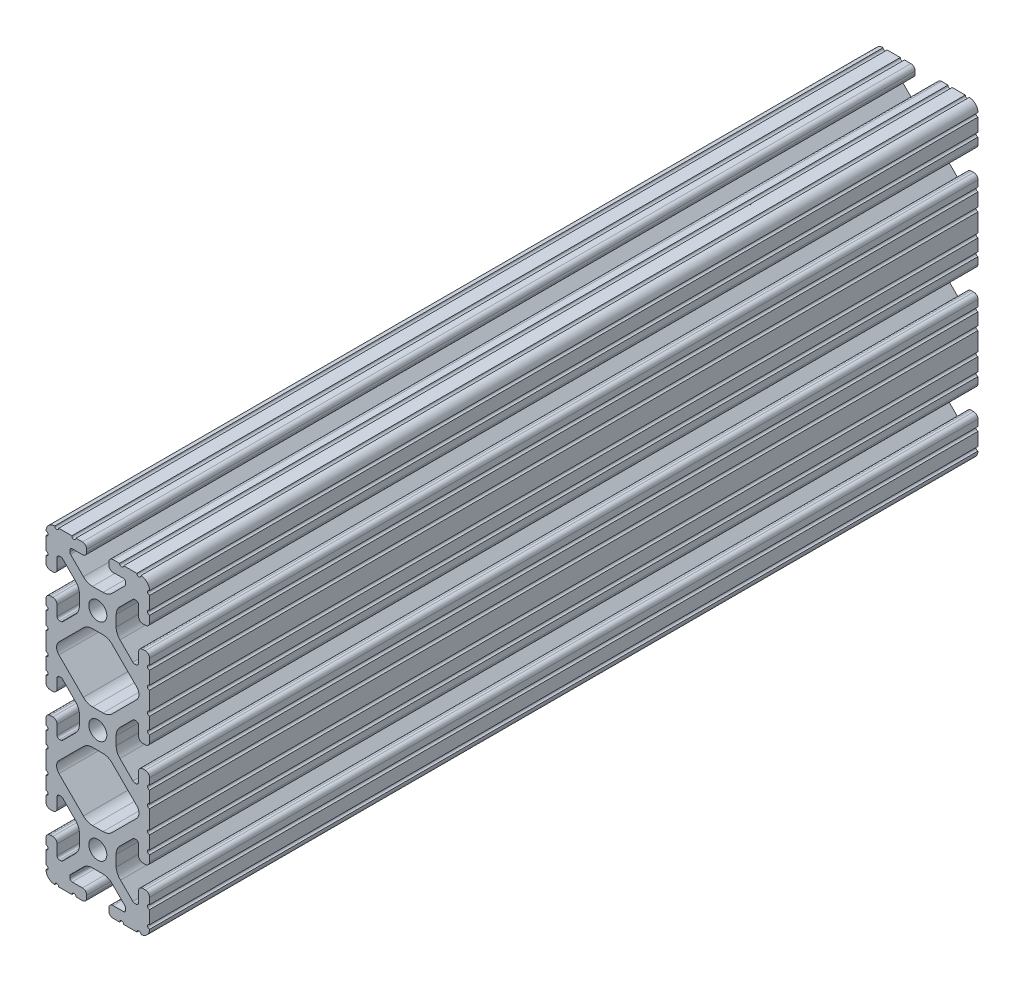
from build123d import *

# Parameters (mm, degrees)
SKETCH1_R      = 3.3274
EXTRUDE1_DEPTH = 304.8


with BuildPart() as part:
    # Sketch1 → Extrude1 (new body)
    with BuildSketch(Plane.XY):
        with BuildLine():
            Line((13.589600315, -10.019462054), (14.097, -10.019462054))
            ThreePointArc((14.097, -10.019462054), (14.725617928, -9.759079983), (14.986, -9.130462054))
            Line((14.986, -9.130462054), (14.986, -5.6388))
            ThreePointArc((14.986, -5.6388), (15.447248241, -4.525248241), (16.5608, -4.064))
            Line((16.5608, -4.064), (17.4752, -4.064))
            ThreePointArc((17.4752, -4.064), (18.588751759, -4.525248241), (19.05, -5.6388))
            Line((19.05, -5.6388), (19.05, -8.023791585))
            ThreePointArc((19.05, -8.023791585), (18.288, -8.785791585), (19.05, -9.547791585))
            Line((19.05, -9.547791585), (19.05, -12.750606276))
            Line((19.05, -12.750606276), (19.05, -13.984497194))
            ThreePointArc((19.05, -13.984497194), (18.288000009, -14.746497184), (19.05, -15.508497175))
            Line((19.05, -15.508497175), (19.05, -22.30100558))
            ThreePointArc((19.05, -22.30100558), (18.288, -23.06300558), (19.05, -23.82500558))
            Line((19.05, -23.82500558), (19.05, -27.813))
            Line((19.05, -27.813), (19.05, -28.653420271))
            ThreePointArc((19.05, -28.653420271), (18.288, -29.415420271), (19.05, -30.177420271))
            Line((19.05, -30.177420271), (19.05, -32.4612))
            ThreePointArc((19.05, -32.4612), (18.588751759, -33.574751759), (17.4752, -34.036))
            Line((17.4752, -34.036), (16.5608, -34.036))
            ThreePointArc((16.5608, -34.036), (15.447248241, -33.574751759), (14.986, -32.4612))
            Line((14.986, -32.4612), (14.986, -28.7208616))
            ThreePointArc((14.986, -28.7208616), (14.725617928, -28.092243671), (14.097, -27.8318616))
            Line((14.097, -27.8318616), (13.547779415, -27.8318616))
            ThreePointArc((13.547779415, -27.8318616), (13.207573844, -27.899532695), (12.919161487, -28.092243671))
            Line((12.919161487, -28.092243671), (8.147584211, -32.863820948))
            ThreePointArc((8.147584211, -32.863820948), (7.117956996, -34.40476697), (6.7564, -36.222436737))
            Line((6.7564, -36.222436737), (6.7564, -40.243886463))
            ThreePointArc((6.7564, -40.243886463), (7.222930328, -42.088789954), (8.376184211, -43.602502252))
            Line((8.376184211, -43.602502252), (12.919161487, -48.145479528))
            ThreePointArc((12.919161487, -48.145479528), (13.207573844, -48.338190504), (13.547779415, -48.4058616))
            Line((13.547779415, -48.4058616), (14.097, -48.4058616))
            ThreePointArc((14.097, -48.4058616), (14.725617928, -48.145479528), (14.986, -47.5168616))
            Line((14.986, -47.5168616), (14.986, -43.7388))
            ThreePointArc((14.986, -43.7388), (15.447248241, -42.625248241), (16.5608, -42.164))
            Line((16.5608, -42.164), (17.4752, -42.164))
            ThreePointArc((17.4752, -42.164), (18.588751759, -42.625248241), (19.05, -43.7388))
            Line((19.05, -43.7388), (19.05, -46.125701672))
            ThreePointArc((19.05, -46.125701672), (18.288, -46.887701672), (19.05, -47.649701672))
            Line((19.05, -47.649701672), (19.05, -48.387))
            Line((19.05, -48.387), (19.05, -52.476140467))
            ThreePointArc((19.05, -52.476140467), (18.2879999, -53.201256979), (19.049898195, -53.92648046))
            ThreePointArc((19.049898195, -53.92648046), (18.099426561, -56.199426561), (15.82648046, -57.149898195))
            ThreePointArc((15.82648046, -57.149898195), (15.101256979, -56.3879999), (14.376140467, -57.15))
            Line((14.376140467, -57.15), (9.549701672, -57.15))
            ThreePointArc((9.549701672, -57.15), (8.787701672, -56.388), (8.025701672, -57.15))
            Line((8.025701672, -57.15), (5.6388, -57.15))
            ThreePointArc((5.6388, -57.15), (4.525248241, -56.688751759), (4.064, -55.5752))
            Line((4.064, -55.5752), (4.064, -54.6608))
            ThreePointArc((4.064, -54.6608), (4.525248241, -53.547248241), (5.6388, -53.086))
            Line((5.6388, -53.086), (9.4168616, -53.086))
            ThreePointArc((9.4168616, -53.086), (10.032142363, -52.831142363), (10.287, -52.2158616))
            Line((10.287, -52.2158616), (10.287, -51.628917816))
            ThreePointArc((10.287, -51.628917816), (10.219328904, -51.288712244), (10.026617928, -51.000299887))
            Line((10.026617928, -51.000299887), (5.273902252, -46.247584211))
            ThreePointArc((5.273902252, -46.247584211), (3.73295623, -45.217956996), (1.915286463, -44.8564))
            Line((1.915286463, -44.8564), (-1.915286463, -44.8564))
            ThreePointArc((-1.915286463, -44.8564), (-3.73295623, -45.217956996), (-5.273902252, -46.247584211))
            Line((-5.273902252, -46.247584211), (-10.026617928, -51.000299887))
            ThreePointArc((-10.026617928, -51.000299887), (-10.219328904, -51.288712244), (-10.287, -51.628917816))
            Line((-10.287, -51.628917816), (-10.287, -52.2158616))
            ThreePointArc((-10.287, -52.2158616), (-10.032142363, -52.831142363), (-9.4168616, -53.086))
            Line((-9.4168616, -53.086), (-5.6388, -53.086))
            ThreePointArc((-5.6388, -53.086), (-4.525248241, -53.547248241), (-4.064, -54.6608))
            Line((-4.064, -54.6608), (-4.064, -55.5752))
            ThreePointArc((-4.064, -55.5752), (-4.525248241, -56.688751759), (-5.6388, -57.15))
            Line((-5.6388, -57.15), (-8.025701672, -57.15))
            ThreePointArc((-8.025701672, -57.15), (-8.787701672, -56.388), (-9.549701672, -57.15))
            Line((-9.549701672, -57.15), (-14.376140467, -57.15))
            ThreePointArc((-14.376140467, -57.15), (-15.101256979, -56.3879999), (-15.82648046, -57.149898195))
            ThreePointArc((-15.82648046, -57.149898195), (-18.099426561, -56.199426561), (-19.049898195, -53.92648046))
            ThreePointArc((-19.049898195, -53.92648046), (-18.2879999, -53.201256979), (-19.05, -52.476140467))
            Line((-19.05, -52.476140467), (-19.05, -48.387))
            Line((-19.05, -48.387), (-19.05, -47.649701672))
            ThreePointArc((-19.05, -47.649701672), (-18.288, -46.887701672), (-19.05, -46.125701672))
            Line((-19.05, -46.125701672), (-19.05, -43.7388))
            ThreePointArc((-19.05, -43.7388), (-18.588751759, -42.625248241), (-17.4752, -42.164))
            Line((-17.4752, -42.164), (-16.5608, -42.164))
            ThreePointArc((-16.5608, -42.164), (-15.447248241, -42.625248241), (-14.986, -43.7388))
            Line((-14.986, -43.7388), (-14.986, -47.5168616))
            ThreePointArc((-14.986, -47.5168616), (-14.725617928, -48.145479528), (-14.097, -48.4058616))
            Line((-14.097, -48.4058616), (-13.547779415, -48.4058616))
            ThreePointArc((-13.547779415, -48.4058616), (-13.207573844, -48.338190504), (-12.919161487, -48.145479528))
            Line((-12.919161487, -48.145479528), (-8.376184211, -43.602502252))
            ThreePointArc((-8.376184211, -43.602502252), (-7.222930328, -42.088789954), (-6.7564, -40.243886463))
            Line((-6.7564, -40.243886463), (-6.7564, -36.222436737))
            ThreePointArc((-6.7564, -36.222436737), (-7.117956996, -34.40476697), (-8.147584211, -32.863820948))
            Line((-8.147584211, -32.863820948), (-12.919161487, -28.092243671))
            ThreePointArc((-12.919161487, -28.092243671), (-13.207573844, -27.899532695), (-13.547779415, -27.8318616))
            Line((-13.547779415, -27.8318616), (-14.097, -27.8318616))
            ThreePointArc((-14.097, -27.8318616), (-14.725617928, -28.092243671), (-14.986, -28.7208616))
            Line((-14.986, -28.7208616), (-14.986, -32.4612))
            ThreePointArc((-14.986, -32.4612), (-15.447248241, -33.574751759), (-16.5608, -34.036))
            Line((-16.5608, -34.036), (-17.4752, -34.036))
            ThreePointArc((-17.4752, -34.036), (-18.588751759, -33.574751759), (-19.05, -32.4612))
            Line((-19.05, -32.4612), (-19.05, -30.177420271))
            ThreePointArc((-19.05, -30.177420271), (-18.288, -29.415420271), (-19.05, -28.653420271))
            Line((-19.05, -28.653420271), (-19.05, -27.813))
            Line((-19.05, -27.813), (-19.05, -23.82500558))
            ThreePointArc((-19.05, -23.82500558), (-18.288, -23.06300558), (-19.05, -22.30100558))
            Line((-19.05, -22.30100558), (-19.05, -15.508497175))
            ThreePointArc((-19.05, -15.508497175), (-18.288000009, -14.746497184), (-19.05, -13.984497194))
            Line((-19.05, -13.984497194), (-19.05, -12.750606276))
            Line((-19.05, -12.750606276), (-19.05, -9.547791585))
            ThreePointArc((-19.05, -9.547791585), (-18.288, -8.785791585), (-19.05, -8.023791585))
            Line((-19.05, -8.023791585), (-19.05, -5.6388))
            ThreePointArc((-19.05, -5.6388), (-18.588751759, -4.525248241), (-17.4752, -4.064))
            Line((-17.4752, -4.064), (-16.5608, -4.064))
            ThreePointArc((-16.5608, -4.064), (-15.447248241, -4.525248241), (-14.986, -5.6388))
            Line((-14.986, -5.6388), (-14.986, -9.130462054))
            ThreePointArc((-14.986, -9.130462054), (-14.725617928, -9.759079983), (-14.097, -10.019462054))
            Line((-14.097, -10.019462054), (-13.589600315, -10.019462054))
            ThreePointArc((-13.589600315, -10.019462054), (-13.249394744, -9.951790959), (-12.960982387, -9.759079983))
            Line((-12.960982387, -9.759079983), (-8.147584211, -4.945681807))
            ThreePointArc((-8.147584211, -4.945681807), (-7.117956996, -3.404735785), (-6.7564, -1.587066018))
            Line((-6.7564, -1.587066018), (-6.7564, 1.587066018))
            ThreePointArc((-6.7564, 1.587066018), (-7.117956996, 3.404735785), (-8.147584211, 4.945681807))
            Line((-8.147584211, 4.945681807), (-12.960982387, 9.759079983))
            ThreePointArc((-12.960982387, 9.759079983), (-13.249394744, 9.951790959), (-13.589600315, 10.019462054))
            Line((-13.589600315, 10.019462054), (-14.097, 10.019462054))
            ThreePointArc((-14.097, 10.019462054), (-14.725617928, 9.759079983), (-14.986, 9.130462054))
            Line((-14.986, 9.130462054), (-14.986, 5.6388))
            ThreePointArc((-14.986, 5.6388), (-15.447248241, 4.525248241), (-16.5608, 4.064))
            Line((-16.5608, 4.064), (-17.4752, 4.064))
            ThreePointArc((-17.4752, 4.064), (-18.588751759, 4.525248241), (-19.05, 5.6388))
            Line((-19.05, 5.6388), (-19.05, 8.023791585))
            ThreePointArc((-19.05, 8.023791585), (-18.288, 8.785791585), (-19.05, 9.547791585))
            Line((-19.05, 9.547791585), (-19.05, 12.750606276))
            Line((-19.05, 12.750606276), (-19.05, 13.984497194))
            ThreePointArc((-19.05, 13.984497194), (-18.288000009, 14.746497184), (-19.05, 15.508497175))
            Line((-19.05, 15.508497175), (-19.05, 22.30100558))
            ThreePointArc((-19.05, 22.30100558), (-18.288, 23.06300558), (-19.05, 23.82500558))
            Line((-19.05, 23.82500558), (-19.05, 27.813))
            Line((-19.05, 27.813), (-19.05, 28.653420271))
            ThreePointArc((-19.05, 28.653420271), (-18.288, 29.415420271), (-19.05, 30.177420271))
            Line((-19.05, 30.177420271), (-19.05, 32.4612))
            ThreePointArc((-19.05, 32.4612), (-18.588751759, 33.574751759), (-17.4752, 34.036))
            Line((-17.4752, 34.036), (-16.5608, 34.036))
            ThreePointArc((-16.5608, 34.036), (-15.447248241, 33.574751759), (-14.986, 32.4612))
            Line((-14.986, 32.4612), (-14.986, 28.7208616))
            ThreePointArc((-14.986, 28.7208616), (-14.725617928, 28.092243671), (-14.097, 27.8318616))
            Line((-14.097, 27.8318616), (-13.547779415, 27.8318616))
            ThreePointArc((-13.547779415, 27.8318616), (-13.207573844, 27.899532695), (-12.919161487, 28.092243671))
            Line((-12.919161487, 28.092243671), (-8.147584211, 32.863820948))
            ThreePointArc((-8.147584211, 32.863820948), (-7.117956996, 34.40476697), (-6.7564, 36.222436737))
            Line((-6.7564, 36.222436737), (-6.7564, 40.243886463))
            ThreePointArc((-6.7564, 40.243886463), (-7.222930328, 42.088789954), (-8.376184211, 43.602502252))
            Line((-8.376184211, 43.602502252), (-12.919161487, 48.145479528))
            ThreePointArc((-12.919161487, 48.145479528), (-13.207573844, 48.338190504), (-13.547779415, 48.4058616))
            Line((-13.547779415, 48.4058616), (-14.097, 48.4058616))
            ThreePointArc((-14.097, 48.4058616), (-14.725617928, 48.145479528), (-14.986, 47.5168616))
            Line((-14.986, 47.5168616), (-14.986, 43.7388))
            ThreePointArc((-14.986, 43.7388), (-15.447248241, 42.625248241), (-16.5608, 42.164))
            Line((-16.5608, 42.164), (-17.4752, 42.164))
            ThreePointArc((-17.4752, 42.164), (-18.588751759, 42.625248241), (-19.05, 43.7388))
            Line((-19.05, 43.7388), (-19.05, 46.125701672))
            ThreePointArc((-19.05, 46.125701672), (-18.288, 46.887701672), (-19.05, 47.649701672))
            Line((-19.05, 47.649701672), (-19.05, 48.387))
            Line((-19.05, 48.387), (-19.05, 52.476140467))
            ThreePointArc((-19.05, 52.476140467), (-18.2879999, 53.201256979), (-19.049898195, 53.92648046))
            ThreePointArc((-19.049898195, 53.92648046), (-18.099426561, 56.199426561), (-15.82648046, 57.149898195))
            ThreePointArc((-15.82648046, 57.149898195), (-15.101256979, 56.3879999), (-14.376140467, 57.15))
            Line((-14.376140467, 57.15), (-9.549701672, 57.15))
            ThreePointArc((-9.549701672, 57.15), (-8.787701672, 56.388), (-8.025701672, 57.15))
            Line((-8.025701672, 57.15), (-5.6388, 57.15))
            ThreePointArc((-5.6388, 57.15), (-4.525248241, 56.688751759), (-4.064, 55.5752))
            Line((-4.064, 55.5752), (-4.064, 54.6608))
            ThreePointArc((-4.064, 54.6608), (-4.525248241, 53.547248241), (-5.6388, 53.086))
            Line((-5.6388, 53.086), (-9.4168616, 53.086))
            ThreePointArc((-9.4168616, 53.086), (-10.032142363, 52.831142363), (-10.287, 52.2158616))
            Line((-10.287, 52.2158616), (-10.287, 51.628917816))
            ThreePointArc((-10.287, 51.628917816), (-10.219328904, 51.288712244), (-10.026617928, 51.000299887))
            Line((-10.026617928, 51.000299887), (-5.273902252, 46.247584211))
            ThreePointArc((-5.273902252, 46.247584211), (-3.73295623, 45.217956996), (-1.915286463, 44.8564))
            Line((-1.915286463, 44.8564), (1.915286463, 44.8564))
            ThreePointArc((1.915286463, 44.8564), (3.73295623, 45.217956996), (5.273902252, 46.247584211))
            Line((5.273902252, 46.247584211), (10.026617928, 51.000299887))
            ThreePointArc((10.026617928, 51.000299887), (10.219328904, 51.288712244), (10.287, 51.628917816))
            Line((10.287, 51.628917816), (10.287, 52.2158616))
            ThreePointArc((10.287, 52.2158616), (10.032142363, 52.831142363), (9.4168616, 53.086))
            Line((9.4168616, 53.086), (5.6388, 53.086))
            ThreePointArc((5.6388, 53.086), (4.525248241, 53.547248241), (4.064, 54.6608))
            Line((4.064, 54.6608), (4.064, 55.5752))
            ThreePointArc((4.064, 55.5752), (4.525248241, 56.688751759), (5.6388, 57.15))
            Line((5.6388, 57.15), (8.025701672, 57.15))
            ThreePointArc((8.025701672, 57.15), (8.787701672, 56.388), (9.549701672, 57.15))
            Line((9.549701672, 57.15), (14.376140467, 57.15))
            ThreePointArc((14.376140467, 57.15), (15.101256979, 56.3879999), (15.82648046, 57.149898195))
            ThreePointArc((15.82648046, 57.149898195), (18.099426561, 56.199426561), (19.049898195, 53.92648046))
            ThreePointArc((19.049898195, 53.92648046), (18.2879999, 53.201256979), (19.05, 52.476140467))
            Line((19.05, 52.476140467), (19.05, 48.387))
            Line((19.05, 48.387), (19.05, 47.649701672))
            ThreePointArc((19.05, 47.649701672), (18.288, 46.887701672), (19.05, 46.125701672))
            Line((19.05, 46.125701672), (19.05, 43.7388))
            ThreePointArc((19.05, 43.7388), (18.588751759, 42.625248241), (17.4752, 42.164))
            Line((17.4752, 42.164), (16.5608, 42.164))
            ThreePointArc((16.5608, 42.164), (15.447248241, 42.625248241), (14.986, 43.7388))
            Line((14.986, 43.7388), (14.986, 47.5168616))
            ThreePointArc((14.986, 47.5168616), (14.725617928, 48.145479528), (14.097, 48.4058616))
            Line((14.097, 48.4058616), (13.547779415, 48.4058616))
            ThreePointArc((13.547779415, 48.4058616), (13.207573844, 48.338190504), (12.919161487, 48.145479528))
            Line((12.919161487, 48.145479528), (8.376184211, 43.602502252))
            ThreePointArc((8.376184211, 43.602502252), (7.222930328, 42.088789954), (6.7564, 40.243886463))
            Line((6.7564, 40.243886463), (6.7564, 36.222436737))
            ThreePointArc((6.7564, 36.222436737), (7.117956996, 34.40476697), (8.147584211, 32.863820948))
            Line((8.147584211, 32.863820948), (12.919161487, 28.092243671))
            ThreePointArc((12.919161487, 28.092243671), (13.207573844, 27.899532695), (13.547779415, 27.8318616))
            Line((13.547779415, 27.8318616), (14.097, 27.8318616))
            ThreePointArc((14.097, 27.8318616), (14.725617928, 28.092243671), (14.986, 28.7208616))
            Line((14.986, 28.7208616), (14.986, 32.4612))
            ThreePointArc((14.986, 32.4612), (15.447248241, 33.574751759), (16.5608, 34.036))
            Line((16.5608, 34.036), (17.4752, 34.036))
            ThreePointArc((17.4752, 34.036), (18.588751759, 33.574751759), (19.05, 32.4612))
            Line((19.05, 32.4612), (19.05, 30.177420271))
            ThreePointArc((19.05, 30.177420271), (18.288, 29.415420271), (19.05, 28.653420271))
            Line((19.05, 28.653420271), (19.05, 27.813))
            Line((19.05, 27.813), (19.05, 23.82500558))
            ThreePointArc((19.05, 23.82500558), (18.288, 23.06300558), (19.05, 22.30100558))
            Line((19.05, 22.30100558), (19.05, 15.508497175))
            ThreePointArc((19.05, 15.508497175), (18.288000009, 14.746497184), (19.05, 13.984497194))
            Line((19.05, 13.984497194), (19.05, 12.750606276))
            Line((19.05, 12.750606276), (19.05, 9.547791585))
            ThreePointArc((19.05, 9.547791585), (18.288, 8.785791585), (19.05, 8.023791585))
            Line((19.05, 8.023791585), (19.05, 5.6388))
            ThreePointArc((19.05, 5.6388), (18.588751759, 4.525248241), (17.4752, 4.064))
            Line((17.4752, 4.064), (16.5608, 4.064))
            ThreePointArc((16.5608, 4.064), (15.447248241, 4.525248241), (14.986, 5.6388))
            Line((14.986, 5.6388), (14.986, 9.130462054))
            ThreePointArc((14.986, 9.130462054), (14.725617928, 9.759079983), (14.097, 10.019462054))
            Line((14.097, 10.019462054), (13.589600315, 10.019462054))
            ThreePointArc((13.589600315, 10.019462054), (13.249394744, 9.951790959), (12.960982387, 9.759079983))
            Line((12.960982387, 9.759079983), (8.147584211, 4.945681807))
            ThreePointArc((8.147584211, 4.945681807), (7.117956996, 3.404735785), (6.7564, 1.587066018))
            Line((6.7564, 1.587066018), (6.7564, -1.587066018))
            ThreePointArc((6.7564, -1.587066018), (7.117956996, -3.404735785), (8.147584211, -4.945681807))
            Line((8.147584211, -4.945681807), (12.960982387, -9.759079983))
            ThreePointArc((12.960982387, -9.759079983), (13.249394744, -9.951790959), (13.589600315, -10.019462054))
        make_face()
        with Locations((0, -38.1)):
            Circle(SKETCH1_R, mode=Mode.SUBTRACT)
        Circle(SKETCH1_R, mode=Mode.SUBTRACT)
        with Locations((0, 38.1)):
            Circle(SKETCH1_R, mode=Mode.SUBTRACT)
        with BuildLine():
            Line((-5.292763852, -7.838225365), (-14.281465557, -16.82692707))
            ThreePointArc((-14.281465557, -16.82692707), (-15.142128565, -18.904751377), (-14.281465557, -20.982575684))
            Line((-14.281465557, -20.982575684), (-5.292763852, -29.971277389))
            ThreePointArc((-5.292763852, -29.971277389), (-3.75181783, -31.000904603), (-1.934148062, -31.3624616))
            Line((-1.934148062, -31.3624616), (1.934148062, -31.3624616))
            ThreePointArc((1.934148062, -31.3624616), (3.75181783, -31.000904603), (5.292763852, -29.971277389))
            Line((5.292763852, -29.971277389), (14.281465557, -20.982575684))
            ThreePointArc((14.281465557, -20.982575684), (15.142128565, -18.904751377), (14.281465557, -16.82692707))
            Line((14.281465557, -16.82692707), (5.292763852, -7.838225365))
            ThreePointArc((5.292763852, -7.838225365), (3.75181783, -6.808598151), (1.934148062, -6.447041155))
            Line((1.934148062, -6.447041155), (-1.934148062, -6.447041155))
            ThreePointArc((-1.934148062, -6.447041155), (-3.75181783, -6.808598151), (-5.292763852, -7.838225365))
        make_face(mode=Mode.SUBTRACT)
        with BuildLine():
            Line((-14.281465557, 20.982575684), (-5.292763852, 29.971277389))
            ThreePointArc((-5.292763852, 29.971277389), (-3.75181783, 31.000904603), (-1.934148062, 31.3624616))
            Line((-1.934148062, 31.3624616), (1.934148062, 31.3624616))
            ThreePointArc((1.934148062, 31.3624616), (3.75181783, 31.000904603), (5.292763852, 29.971277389))
            Line((5.292763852, 29.971277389), (14.281465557, 20.982575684))
            ThreePointArc((14.281465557, 20.982575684), (15.142128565, 18.904751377), (14.281465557, 16.82692707))
            Line((14.281465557, 16.82692707), (5.292763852, 7.838225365))
            ThreePointArc((5.292763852, 7.838225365), (3.75181783, 6.808598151), (1.934148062, 6.447041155))
            Line((1.934148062, 6.447041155), (-1.934148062, 6.447041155))
            ThreePointArc((-1.934148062, 6.447041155), (-3.75181783, 6.808598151), (-5.292763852, 7.838225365))
            Line((-5.292763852, 7.838225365), (-14.281465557, 16.82692707))
            ThreePointArc((-14.281465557, 16.82692707), (-15.142128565, 18.904751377), (-14.281465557, 20.982575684))
        make_face(mode=Mode.SUBTRACT)
    extrude(amount=-EXTRUDE1_DEPTH)


solid = part.part
